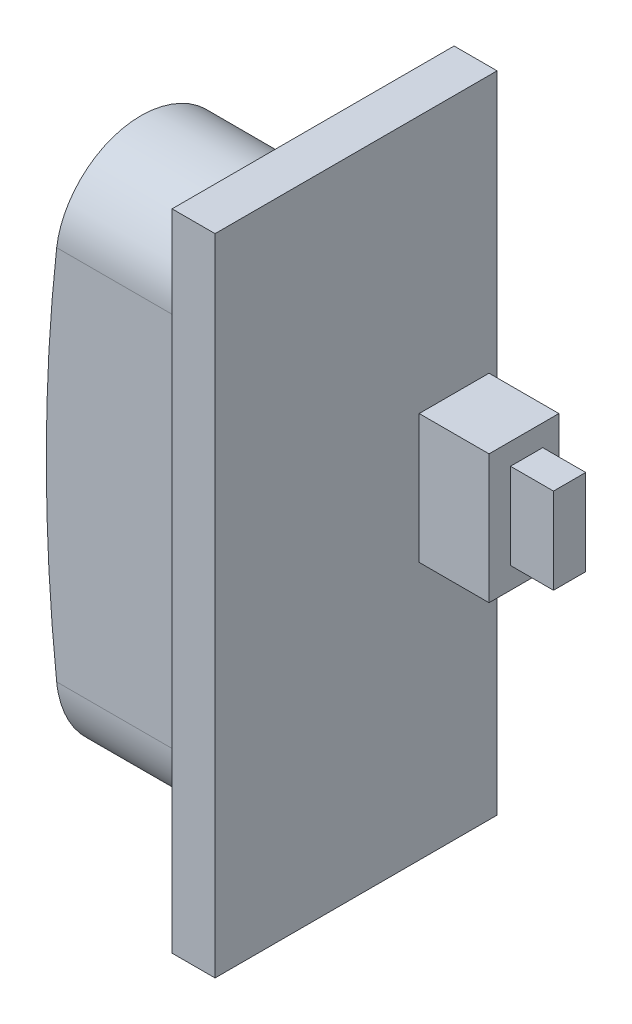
from build123d import *

# Parameters (mm, degrees)
BUTTON_CAPTIVE_FLANGE_LIGHT_BAFFLE_START   = 3.55
BUTTON_CAPTIVE_FLANGE_LIGHT_BAFFLE_SKETC_W = 0.8
BUTTON_CAPTIVE_FLANGE_LIGHT_BAFFLE_SKETC_H = 12
BUTTON_CAPTIVE_FLANGE_LIGHT_BAFFLE_DEPTH   = 5.25
CAPSULE_PRESS_FACE_10X3_R1_5_START         = -34
CAPSULE_PRESS_FACE_10X3_R1_5_DEPTH         = 5.8
BUTTON_STEM_ROOT_START                     = 3.7
BUTTON_STEM_ROOT_SKETCH_W                  = 1.3
BUTTON_STEM_ROOT_SKETCH_H                  = 2.4
BUTTON_STEM_ROOT_DEPTH                     = 1.3
SW1_CONTACT_TIP_NOMINAL_GAP0_35_START      = 4
SW1_CONTACT_TIP_NOMINAL_GAP0_35_SKETCH_W   = 0.8
SW1_CONTACT_TIP_NOMINAL_GAP0_35_SKETCH_H   = 1.6
SW1_CONTACT_TIP_NOMINAL_GAP0_35_DEPTH      = 0.6


with BuildPart() as part:
    # Button_captive_flange_light_baffle_Sketc → Button_captive_flange_light_baffle (new body)
    with BuildSketch(Plane.XY.offset(BUTTON_CAPTIVE_FLANGE_LIGHT_BAFFLE_START)):
        with Locations((-28.2, 0)):
            Rectangle(BUTTON_CAPTIVE_FLANGE_LIGHT_BAFFLE_SKETC_W, BUTTON_CAPTIVE_FLANGE_LIGHT_BAFFLE_SKETC_H)
    extrude(amount=BUTTON_CAPTIVE_FLANGE_LIGHT_BAFFLE_DEPTH)

    # Capsule_press_face_10x3_R1_5_Sketch → Capsule_press_face_10x3_R1_5 (add)
    with BuildSketch(Plane(origin=(0, 0, 0), x_dir=(0, 0, -1), z_dir=(1, 0, 0)).offset(CAPSULE_PRESS_FACE_10X3_R1_5_START)):
        with BuildLine():
            Line((-5, -3.5), (-5, 3.5))
            ThreePointArc((-5, 3.5), (-5.439339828, 4.560660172), (-6.5, 5))
            ThreePointArc((-6.5, 5), (-7.560660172, 4.560660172), (-8, 3.5))
            Line((-8, 3.5), (-8, -3.5))
            ThreePointArc((-8, -3.5), (-7.560660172, -4.560660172), (-6.5, -5))
            ThreePointArc((-6.5, -5), (-5.439339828, -4.560660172), (-5, -3.5))
        make_face()
    extrude(amount=CAPSULE_PRESS_FACE_10X3_R1_5_DEPTH)

    # Button_stem_root_Sketch → Button_stem_root (add)
    with BuildSketch(Plane.XY.offset(BUTTON_STEM_ROOT_START)):
        with Locations((-27.15, 0)):
            Rectangle(BUTTON_STEM_ROOT_SKETCH_W, BUTTON_STEM_ROOT_SKETCH_H)
    extrude(amount=BUTTON_STEM_ROOT_DEPTH)

    # SW1_contact_tip_nominal_gap0_35_Sketch → SW1_contact_tip_nominal_gap0_35 (add)
    with BuildSketch(Plane.XY.offset(SW1_CONTACT_TIP_NOMINAL_GAP0_35_START)):
        with Locations((-26.1, 0)):
            Rectangle(SW1_CONTACT_TIP_NOMINAL_GAP0_35_SKETCH_W, SW1_CONTACT_TIP_NOMINAL_GAP0_35_SKETCH_H)
    extrude(amount=SW1_CONTACT_TIP_NOMINAL_GAP0_35_DEPTH)

    # Face_surface_projection0_8_section → Curved_face_projection0_8 (revolve, cut)
    with BuildSketch(Plane(origin=(0, 0, 0), x_dir=(1, 0, 0), z_dir=(0, 1, 0))):
        with BuildLine():
            Line((28.206104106, 0), (40, 0))
            Line((40, 0), (40, -13.7))
            Line((40, -13.7), (28.6, -13.7))
            ThreePointArc((28.6, -13.7), (31.796441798, -6.75243487), (28.206104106, 0))
        make_face()
    revolve(axis=Axis((0, 0, 0), (0, 0, 1)), mode=Mode.SUBTRACT)


solid = part.part
